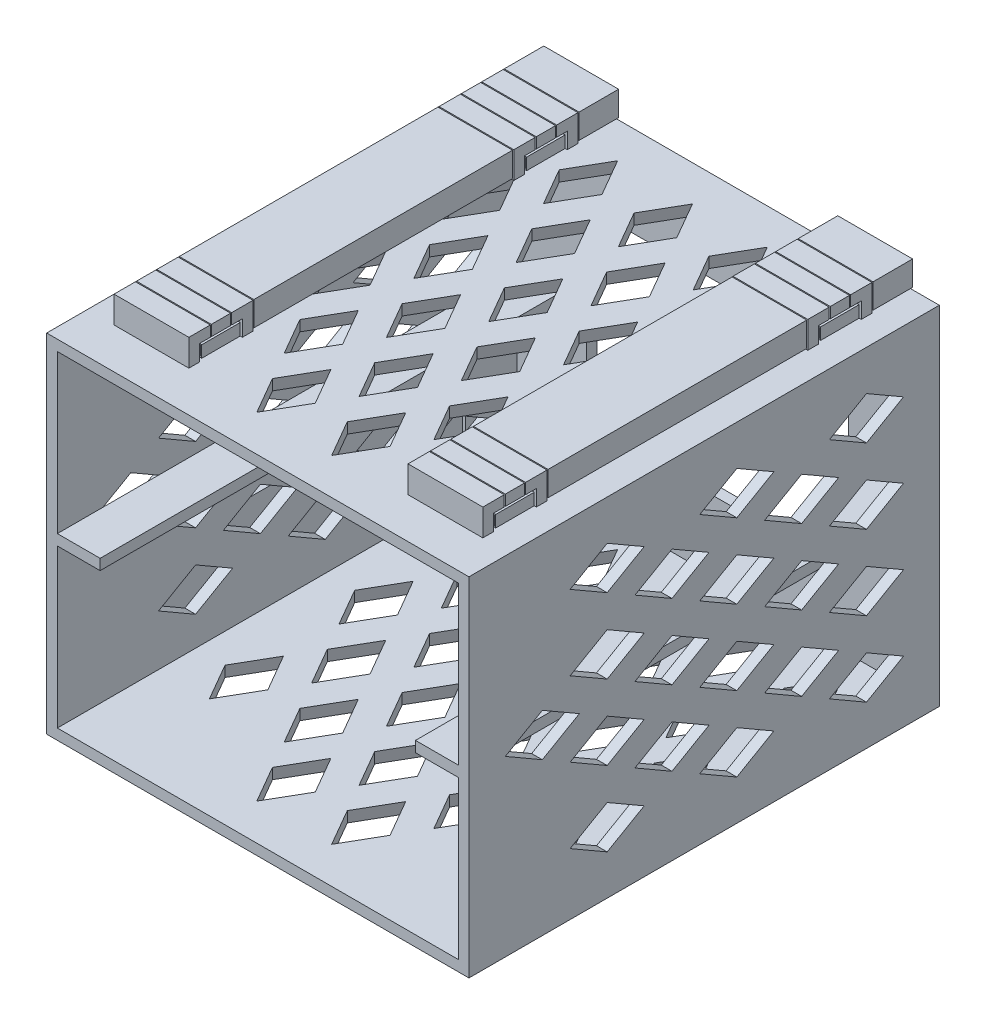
from build123d import *

# Parameters (mm, degrees)
CROQUIS1_W          = 79
CROQUIS1_H          = 65
CROQUIS1_W_2        = 49
CROQUIS1_H_2        = 35
FONDO_DEPTH         = 2
CROQUIS3_W          = 79
CROQUIS3_H          = 65
CROQUIS3_W_2        = 75
CROQUIS3_H_2        = 61
ESTRUCTURA_DEPTH    = 86
ROMBOSHOR_REACH     = 124.643
ROMBOSVERT_DEPTH    = 65
CROQUIS8_W          = 8
CROQUIS8_H          = 2
GUIAS_DEPTH         = 86
CROQUIS12_W         = 14
CROQUIS12_H         = 2
ANCSUP01_DEPTH      = 3
CROQUIS13_W         = 14
CROQUIS13_H         = 4
ANCSUP02_DEPTH      = 2
CROQUIS52_W         = 2
CROQUIS52_H         = 14
ANCIZQ01_DEPTH      = 3
CROQUIS53_W         = 4
CROQUIS53_H         = 14
ANCIZQ02_DEPTH      = 2
CROQUIS61_W         = 14
CROQUIS61_H         = 4.6
CROQUIS61_W_2       = 13.6
CROQUIS61_H_2       = 4.2
ESPANCSUP01_DEPTH   = 7.404
ESPANCSUP01_2_DEPTH = 7.404
CROQUIS57_W         = 13.954269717
CROQUIS57_H         = 4.6
CROQUIS57_W_2       = 13.554269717
CROQUIS57_H_2       = 4.2
ESPANCSUP02_DEPTH   = 48.392
ESPANCSUP02_2_DEPTH = 48.392
CROQUIS58_W         = 12.554269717
CROQUIS58_H         = 3.2
CROQUIS58_W_2       = 12.154269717
CROQUIS58_H_2       = 2.8
ESPANCSUP03_DEPTH   = 48.392
ESPANCSUP03_2_DEPTH = 48.392
CROQUIS59_W         = 11.154269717
CROQUIS59_H         = 1.8
CROQUIS59_W_2       = 10.754269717
CROQUIS59_H_2       = 1.4
ESPANCSUP04_DEPTH   = 48.392
ESPANCSUP04_2_DEPTH = 48.392
CROQUIS64_W         = 14
CROQUIS64_H         = 7.2
ESPANCSUP05_DEPTH   = 2.2
ESPANCSUP05_2_DEPTH = 2.2
ESPANCSUP05_3_DEPTH = 2.2
ESPANCSUP05_4_DEPTH = 2.2
CROQUIS66_W         = 13.6
CROQUIS66_H         = 1.8
ESPANCSUP06_DEPTH   = 7.2
CROQUIS68_W         = 13.6
CROQUIS68_H         = 1.8
ESPANCSUP07_DEPTH   = 7.2
CROQUIS70_W         = 14
CROQUIS70_H         = 3.6
ESPANCSUP08_DEPTH   = 2
ESPANCSUP08_2_DEPTH = 2
ESPANCSUP08_3_DEPTH = 2
ESPANCSUP08_4_DEPTH = 2
CROQUIS71_W         = 13.6
CROQUIS71_H         = 1.6
ESPANCSUP09_DEPTH   = 3.6
CROQUIS72_W         = 13.6
CROQUIS72_H         = 1.6
ESPANCSUP10_DEPTH   = 3.6
CROQUIS73_W         = 4.6
CROQUIS73_H         = 14
CROQUIS73_W_2       = 4.2
CROQUIS73_H_2       = 13.6
ESPANCIZQ01_DEPTH   = 7.404
ESPANCIZQ01_2_DEPTH = 7.404
CROQUIS74_W         = 4.6
CROQUIS74_H         = 14
CROQUIS74_W_2       = 4.2
CROQUIS74_H_2       = 13.6
ESPANCIZQ02_DEPTH   = 48.392
ESPANCIZQ02_2_DEPTH = 48.392
CROQUIS75_W         = 3.2
CROQUIS75_H         = 12.6
CROQUIS75_W_2       = 2.8
CROQUIS75_H_2       = 12.2
ESPANCIZQ03_DEPTH   = 48.392
ESPANCIZQ03_2_DEPTH = 48.392
CROQUIS76_W         = 1.8
CROQUIS76_H         = 11.2
CROQUIS76_W_2       = 1.4
CROQUIS76_H_2       = 10.8
ESPANCIZQ04_DEPTH   = 48.392
ESPANCIZQ04_2_DEPTH = 48.392
CROQUIS77_W         = 7.6
CROQUIS77_H         = 14
ESPANCIZQ05_DEPTH   = 2.2
ESPANCIZQ05_2_DEPTH = 2.2
ESPANCIZQ05_3_DEPTH = 2.2
ESPANCIZQ05_4_DEPTH = 2.2
CROQUIS78_W         = 1.8
CROQUIS78_H         = 13.6
ESPANCIZQ06_DEPTH   = 7.6
CROQUIS79_W         = 1.8
CROQUIS79_H         = 13.6
ESPANCIZQ07_DEPTH   = 7.6
CROQUIS80_W         = 3.6
CROQUIS80_H         = 14
ESPANCIZQ08_DEPTH   = 2
ESPANCIZQ08_2_DEPTH = 2
ESPANCIZQ08_3_DEPTH = 2
ESPANCIZQ08_4_DEPTH = 2
CROQUIS81_W         = 1.6
CROQUIS81_H         = 13.6
ESPANCIZQ09_DEPTH   = 3.6
CROQUIS82_W         = 1.6
CROQUIS82_H         = 13.6
ESPANCIZQ10_DEPTH   = 3.6


with BuildPart() as part:
    # Croquis1 → Fondo (new body)
    with BuildSketch(Plane(origin=(0, 0, 0), x_dir=(-1, 0, 0), z_dir=(0, 0, -1))):
        Rectangle(CROQUIS1_W, CROQUIS1_H)
        Rectangle(CROQUIS1_W_2, CROQUIS1_H_2, mode=Mode.SUBTRACT)
    extrude(amount=-FONDO_DEPTH)

    # Croquis3 → Estructura (add)
    with BuildSketch(Plane.XY.offset(2)):
        Rectangle(CROQUIS3_W, CROQUIS3_H)
        Rectangle(CROQUIS3_W_2, CROQUIS3_H_2, mode=Mode.SUBTRACT)
    extrude(amount=ESTRUCTURA_DEPTH)

    # RombosHor: up to this face of the body (flat: up to its plane)
    romboshor_end = Plane(part.part.faces().sort_by_distance((39.5, 0, 44))[0])
    # Croquis5 → RombosHor (cut, up to the picked face)
    with BuildSketch(Plane.ZY.offset(39.5), mode=Mode.PRIVATE) as romboshor_sk1:
        Polygon((13.628, 25), (20.556, 21), (13.628, 17), (6.7, 21), align=None)
    romboshor_tool1 = split(extrude(romboshor_sk1.sketch, amount=-ROMBOSHOR_REACH, mode=Mode.PRIVATE), bisect_by=romboshor_end, keep=Keep.BOTH, mode=Mode.PRIVATE)
    # Croquis5 → RombosHor (cut, up to the picked face)
    with BuildSketch(Plane.ZY.offset(39.5), mode=Mode.PRIVATE) as romboshor_sk2:
        Polygon((13.628, 11), (20.556, 7), (13.628, 3), (6.7, 7), align=None)
    romboshor_tool2 = split(extrude(romboshor_sk2.sketch, amount=-ROMBOSHOR_REACH, mode=Mode.PRIVATE), bisect_by=romboshor_end, keep=Keep.BOTH, mode=Mode.PRIVATE)
    # Croquis5 → RombosHor (cut, up to the picked face)
    with BuildSketch(Plane.ZY.offset(39.5), mode=Mode.PRIVATE) as romboshor_sk3:
        Polygon((13.628, -3), (20.556, -7), (13.628, -11), (6.7, -7), align=None)
    romboshor_tool3 = split(extrude(romboshor_sk3.sketch, amount=-ROMBOSHOR_REACH, mode=Mode.PRIVATE), bisect_by=romboshor_end, keep=Keep.BOTH, mode=Mode.PRIVATE)
    # Croquis5 → RombosHor (cut, up to the picked face)
    with BuildSketch(Plane.ZY.offset(39.5), mode=Mode.PRIVATE) as romboshor_sk4:
        Polygon((13.628, -17), (20.556, -21), (13.628, -25), (6.7, -21), align=None)
    romboshor_tool4 = split(extrude(romboshor_sk4.sketch, amount=-ROMBOSHOR_REACH, mode=Mode.PRIVATE), bisect_by=romboshor_end, keep=Keep.BOTH, mode=Mode.PRIVATE)
    # Croquis5 → RombosHor (cut, up to the picked face)
    with BuildSketch(Plane.ZY.offset(39.5), mode=Mode.PRIVATE) as romboshor_sk5:
        Polygon((37.884, 25), (44.812, 21), (37.884, 17), (30.956, 21), align=None)
    romboshor_tool5 = split(extrude(romboshor_sk5.sketch, amount=-ROMBOSHOR_REACH, mode=Mode.PRIVATE), bisect_by=romboshor_end, keep=Keep.BOTH, mode=Mode.PRIVATE)
    # Croquis5 → RombosHor (cut, up to the picked face)
    with BuildSketch(Plane.ZY.offset(39.5), mode=Mode.PRIVATE) as romboshor_sk6:
        Polygon((44.812, 7), (37.884, 3), (30.956, 7), (37.884, 11), align=None)
    romboshor_tool6 = split(extrude(romboshor_sk6.sketch, amount=-ROMBOSHOR_REACH, mode=Mode.PRIVATE), bisect_by=romboshor_end, keep=Keep.BOTH, mode=Mode.PRIVATE)
    # Croquis5 → RombosHor (cut, up to the picked face)
    with BuildSketch(Plane.ZY.offset(39.5), mode=Mode.PRIVATE) as romboshor_sk7:
        Polygon((44.812, -7), (37.884, -11), (30.956, -7), (37.884, -3), align=None)
    romboshor_tool7 = split(extrude(romboshor_sk7.sketch, amount=-ROMBOSHOR_REACH, mode=Mode.PRIVATE), bisect_by=romboshor_end, keep=Keep.BOTH, mode=Mode.PRIVATE)
    # Croquis5 → RombosHor (cut, up to the picked face)
    with BuildSketch(Plane.ZY.offset(39.5), mode=Mode.PRIVATE) as romboshor_sk8:
        Polygon((37.884, -17), (44.812, -21), (37.884, -25), (30.956, -21), align=None)
    romboshor_tool8 = split(extrude(romboshor_sk8.sketch, amount=-ROMBOSHOR_REACH, mode=Mode.PRIVATE), bisect_by=romboshor_end, keep=Keep.BOTH, mode=Mode.PRIVATE)
    # Croquis5 → RombosHor (cut, up to the picked face)
    with BuildSketch(Plane.ZY.offset(39.5), mode=Mode.PRIVATE) as romboshor_sk9:
        Polygon((62.14, 25), (69.068, 21), (62.14, 17), (55.212, 21), align=None)
    romboshor_tool9 = split(extrude(romboshor_sk9.sketch, amount=-ROMBOSHOR_REACH, mode=Mode.PRIVATE), bisect_by=romboshor_end, keep=Keep.BOTH, mode=Mode.PRIVATE)
    # Croquis5 → RombosHor (cut, up to the picked face)
    with BuildSketch(Plane.ZY.offset(39.5), mode=Mode.PRIVATE) as romboshor_sk10:
        Polygon((69.068, 7), (62.14, 3), (55.212, 7), (62.14, 11), align=None)
    romboshor_tool10 = split(extrude(romboshor_sk10.sketch, amount=-ROMBOSHOR_REACH, mode=Mode.PRIVATE), bisect_by=romboshor_end, keep=Keep.BOTH, mode=Mode.PRIVATE)
    # Croquis5 → RombosHor (cut, up to the picked face)
    with BuildSketch(Plane.ZY.offset(39.5), mode=Mode.PRIVATE) as romboshor_sk11:
        Polygon((69.068, -7), (62.14, -11), (55.212, -7), (62.14, -3), align=None)
    romboshor_tool11 = split(extrude(romboshor_sk11.sketch, amount=-ROMBOSHOR_REACH, mode=Mode.PRIVATE), bisect_by=romboshor_end, keep=Keep.BOTH, mode=Mode.PRIVATE)
    # Croquis5 → RombosHor (cut, up to the picked face)
    with BuildSketch(Plane.ZY.offset(39.5), mode=Mode.PRIVATE) as romboshor_sk12:
        Polygon((62.14, -17), (69.068, -21), (62.14, -25), (55.212, -21), align=None)
    romboshor_tool12 = split(extrude(romboshor_sk12.sketch, amount=-ROMBOSHOR_REACH, mode=Mode.PRIVATE), bisect_by=romboshor_end, keep=Keep.BOTH, mode=Mode.PRIVATE)
    # Croquis5 → RombosHor (cut, up to the picked face)
    with BuildSketch(Plane.ZY.offset(39.5), mode=Mode.PRIVATE) as romboshor_sk13:
        Polygon((50.012, 18), (56.94, 14), (50.012, 10), (43.084, 14), align=None)
    romboshor_tool13 = split(extrude(romboshor_sk13.sketch, amount=-ROMBOSHOR_REACH, mode=Mode.PRIVATE), bisect_by=romboshor_end, keep=Keep.BOTH, mode=Mode.PRIVATE)
    # Croquis5 → RombosHor (cut, up to the picked face)
    with BuildSketch(Plane.ZY.offset(39.5), mode=Mode.PRIVATE) as romboshor_sk14:
        Polygon((50.012, 4), (56.94, 0), (50.012, -4), (43.084, 0), align=None)
    romboshor_tool14 = split(extrude(romboshor_sk14.sketch, amount=-ROMBOSHOR_REACH, mode=Mode.PRIVATE), bisect_by=romboshor_end, keep=Keep.BOTH, mode=Mode.PRIVATE)
    # Croquis5 → RombosHor (cut, up to the picked face)
    with BuildSketch(Plane.ZY.offset(39.5), mode=Mode.PRIVATE) as romboshor_sk15:
        Polygon((56.94, -14), (50.012, -18), (43.084, -14), (50.012, -10), align=None)
    romboshor_tool15 = split(extrude(romboshor_sk15.sketch, amount=-ROMBOSHOR_REACH, mode=Mode.PRIVATE), bisect_by=romboshor_end, keep=Keep.BOTH, mode=Mode.PRIVATE)
    # Croquis5 → RombosHor (cut, up to the picked face)
    with BuildSketch(Plane.ZY.offset(39.5), mode=Mode.PRIVATE) as romboshor_sk16:
        Polygon((18.828, 14), (25.756, 18), (32.684, 14), (25.756, 10), align=None)
    romboshor_tool16 = split(extrude(romboshor_sk16.sketch, amount=-ROMBOSHOR_REACH, mode=Mode.PRIVATE), bisect_by=romboshor_end, keep=Keep.BOTH, mode=Mode.PRIVATE)
    # Croquis5 → RombosHor (cut, up to the picked face)
    with BuildSketch(Plane.ZY.offset(39.5), mode=Mode.PRIVATE) as romboshor_sk17:
        Polygon((25.756, 4), (32.684, 0), (25.756, -4), (18.828, 0), align=None)
    romboshor_tool17 = split(extrude(romboshor_sk17.sketch, amount=-ROMBOSHOR_REACH, mode=Mode.PRIVATE), bisect_by=romboshor_end, keep=Keep.BOTH, mode=Mode.PRIVATE)
    # Croquis5 → RombosHor (cut, up to the picked face)
    with BuildSketch(Plane.ZY.offset(39.5), mode=Mode.PRIVATE) as romboshor_sk18:
        Polygon((25.756, -18), (18.828, -14), (25.756, -10), (32.684, -14), align=None)
    romboshor_tool18 = split(extrude(romboshor_sk18.sketch, amount=-ROMBOSHOR_REACH, mode=Mode.PRIVATE), bisect_by=romboshor_end, keep=Keep.BOTH, mode=Mode.PRIVATE)
    # Croquis5 → RombosHor (cut, up to the picked face)
    with BuildSketch(Plane.ZY.offset(39.5), mode=Mode.PRIVATE) as romboshor_sk19:
        Polygon((81.196, 0), (74.268, -4), (67.34, 0), (74.268, 4), align=None)
    romboshor_tool19 = split(extrude(romboshor_sk19.sketch, amount=-ROMBOSHOR_REACH, mode=Mode.PRIVATE), bisect_by=romboshor_end, keep=Keep.BOTH, mode=Mode.PRIVATE)
    add(romboshor_tool1.solids().sort_by(Axis((-39.5, 21, 13.628), (1, 0, 0)))[0], mode=Mode.SUBTRACT)
    add(romboshor_tool2.solids().sort_by(Axis((-39.5, 7, 13.628), (1, 0, 0)))[0], mode=Mode.SUBTRACT)
    add(romboshor_tool3.solids().sort_by(Axis((-39.5, -7, 13.628), (1, 0, 0)))[0], mode=Mode.SUBTRACT)
    add(romboshor_tool4.solids().sort_by(Axis((-39.5, -21, 13.628), (1, 0, 0)))[0], mode=Mode.SUBTRACT)
    add(romboshor_tool5.solids().sort_by(Axis((-39.5, 21, 37.884), (1, 0, 0)))[0], mode=Mode.SUBTRACT)
    add(romboshor_tool6.solids().sort_by(Axis((-39.5, 7, 37.884), (1, 0, 0)))[0], mode=Mode.SUBTRACT)
    add(romboshor_tool7.solids().sort_by(Axis((-39.5, -7, 37.884), (1, 0, 0)))[0], mode=Mode.SUBTRACT)
    add(romboshor_tool8.solids().sort_by(Axis((-39.5, -21, 37.884), (1, 0, 0)))[0], mode=Mode.SUBTRACT)
    add(romboshor_tool9.solids().sort_by(Axis((-39.5, 21, 62.14), (1, 0, 0)))[0], mode=Mode.SUBTRACT)
    add(romboshor_tool10.solids().sort_by(Axis((-39.5, 7, 62.14), (1, 0, 0)))[0], mode=Mode.SUBTRACT)
    add(romboshor_tool11.solids().sort_by(Axis((-39.5, -7, 62.14), (1, 0, 0)))[0], mode=Mode.SUBTRACT)
    add(romboshor_tool12.solids().sort_by(Axis((-39.5, -21, 62.14), (1, 0, 0)))[0], mode=Mode.SUBTRACT)
    add(romboshor_tool13.solids().sort_by(Axis((-39.5, 14, 50.012), (1, 0, 0)))[0], mode=Mode.SUBTRACT)
    add(romboshor_tool14.solids().sort_by(Axis((-39.5, 0, 50.012), (1, 0, 0)))[0], mode=Mode.SUBTRACT)
    add(romboshor_tool15.solids().sort_by(Axis((-39.5, -14, 50.012), (1, 0, 0)))[0], mode=Mode.SUBTRACT)
    add(romboshor_tool16.solids().sort_by(Axis((-39.5, 14, 25.756), (1, 0, 0)))[0], mode=Mode.SUBTRACT)
    add(romboshor_tool17.solids().sort_by(Axis((-39.5, 0, 25.756), (1, 0, 0)))[0], mode=Mode.SUBTRACT)
    add(romboshor_tool18.solids().sort_by(Axis((-39.5, -14, 25.756), (1, 0, 0)))[0], mode=Mode.SUBTRACT)
    add(romboshor_tool19.solids().sort_by(Axis((-39.5, 0, 74.268), (1, 0, 0)))[0], mode=Mode.SUBTRACT)

    # Croquis9 → RombosVert (cut)
    with BuildSketch(Plane(origin=(0, 32.5, 0), x_dir=(1, 0, 0), z_dir=(0, 1, 0))):
        Polygon((28, -6.68718177), (24, -13.615385), (28, -20.543588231), (32, -13.615385), align=None)
        Polygon((14, -6.68718177), (10, -13.615385), (14, -20.543588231), (18, -13.615385), align=None)
        Polygon((0, -6.68718177), (-4, -13.615385), (0, -20.543588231), (4, -13.615385), align=None)
        Polygon((-14, -6.68718177), (-18, -13.615385), (-14, -20.543588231), (-10, -13.615385), align=None)
        Polygon((-28, -6.68718177), (-32, -13.615385), (-28, -20.543588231), (-24, -13.615385), align=None)
        Polygon((14, -30.94359177), (10, -37.871795), (14, -44.799998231), (18, -37.871795), align=None)
        Polygon((0, -30.94359177), (-4, -37.871795), (0, -44.799998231), (4, -37.871795), align=None)
        Polygon((-14, -30.94359177), (-18, -37.871795), (-14, -44.799998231), (-10, -37.871795), align=None)
        Polygon((-28, -30.94359177), (-32, -37.871795), (-28, -44.799998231), (-24, -37.871795), align=None)
        Polygon((14, -55.20000177), (10, -62.128205), (14, -69.056408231), (18, -62.128205), align=None)
        Polygon((0, -55.20000177), (-4, -62.128205), (0, -69.056408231), (4, -62.128205), align=None)
        Polygon((-14, -55.20000177), (-18, -62.128205), (-14, -69.056408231), (-10, -62.128205), align=None)
        Polygon((-28, -55.20000177), (-32, -62.128205), (-28, -69.056408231), (-24, -62.128205), align=None)
        Polygon((28, -30.94359177), (24, -37.871795), (28, -44.799998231), (32, -37.871795), align=None)
        Polygon((28, -55.20000177), (24, -62.128205), (28, -69.056408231), (32, -62.128205), align=None)
        Polygon((17, -50.001795), (21, -56.929998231), (25, -50.001795), (21, -43.07359177), align=None)
        Polygon((7, -67.33000177), (11, -74.258205), (7, -81.186408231), (3, -74.258205), align=None)
        Polygon((-7, -67.33000177), (-11, -74.258205), (-7, -81.186408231), (-3, -74.258205), align=None)
        Polygon((7, -18.81718177), (3, -25.745385), (7, -32.673588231), (11, -25.745385), align=None)
        Polygon((17, -25.745385), (21, -32.673588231), (25, -25.745385), (21, -18.81718177), align=None)
        Polygon((-7, -43.07359177), (-11, -50.001795), (-7, -56.929998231), (-3, -50.001795), align=None)
        Polygon((-21, -43.07359177), (-25, -50.001795), (-21, -56.929998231), (-17, -50.001795), align=None)
        Polygon((-3, -25.745385), (-7, -32.673588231), (-11, -25.745385), (-7, -18.81718177), align=None)
        Polygon((-21, -18.81718177), (-17, -25.745385), (-21, -32.673588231), (-25, -25.745385), align=None)
        Polygon((7, -43.07359177), (3, -50.001795), (7, -56.929998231), (11, -50.001795), align=None)
    extrude(amount=-ROMBOSVERT_DEPTH, mode=Mode.SUBTRACT)

    # Croquis8 → Guias (add)
    with BuildSketch(Plane.XY.offset(2)):
        with Locations((-33.5, 0)):
            Rectangle(CROQUIS8_W, CROQUIS8_H)
        with Locations((33.5, 0)):
            Rectangle(CROQUIS8_W, CROQUIS8_H)
    extrude(amount=GUIAS_DEPTH)

    # Croquis12 → AncSup01 (add)
    with BuildSketch(Plane(origin=(0, 32.5, 0), x_dir=(1, 0, 0), z_dir=(0, 1, 0))):
        with Locations((27.5, -8.604)):
            Rectangle(CROQUIS12_W, CROQUIS12_H)
        with Locations((27.5, -18.604)):
            Rectangle(CROQUIS12_W, CROQUIS12_H)
        with Locations((-27.5, -79.396)):
            Rectangle(CROQUIS12_W, CROQUIS12_H)
        with Locations((-27.5, -69.396)):
            Rectangle(CROQUIS12_W, CROQUIS12_H)
        with Locations((27.5, -69.396)):
            Rectangle(CROQUIS12_W, CROQUIS12_H)
        with Locations((-27.5, -18.604)):
            Rectangle(CROQUIS12_W, CROQUIS12_H)
        with Locations((-27.5, -8.604)):
            Rectangle(CROQUIS12_W, CROQUIS12_H)
        with Locations((27.5, -79.396)):
            Rectangle(CROQUIS12_W, CROQUIS12_H)
    extrude(amount=ANCSUP01_DEPTH)

    # Croquis13 → AncSup02 (add)
    with BuildSketch(Plane(origin=(0, 35.5, 0), x_dir=(1, 0, 0), z_dir=(0, 1, 0))):
        with Locations((-27.5, -9.604)):
            Rectangle(CROQUIS13_W, CROQUIS13_H)
        with Locations((-27.5, -17.604)):
            Rectangle(CROQUIS13_W, CROQUIS13_H)
        with Locations((27.5, -17.604)):
            Rectangle(CROQUIS13_W, CROQUIS13_H)
        with Locations((27.5, -9.604)):
            Rectangle(CROQUIS13_W, CROQUIS13_H)
        with Locations((27.5, -78.396)):
            Rectangle(CROQUIS13_W, CROQUIS13_H)
        with Locations((27.5, -70.396)):
            Rectangle(CROQUIS13_W, CROQUIS13_H)
        with Locations((-27.5, -70.396)):
            Rectangle(CROQUIS13_W, CROQUIS13_H)
        with Locations((-27.5, -78.396)):
            Rectangle(CROQUIS13_W, CROQUIS13_H)
    extrude(amount=ANCSUP02_DEPTH)

    # Croquis52 → AncIzq01 (add)
    with BuildSketch(Plane.ZY.offset(39.5)):
        with Locations((8.604, -20.5)):
            Rectangle(CROQUIS52_W, CROQUIS52_H)
        with Locations((18.604, -20.5)):
            Rectangle(CROQUIS52_W, CROQUIS52_H)
        with Locations((79.396, 20.5)):
            Rectangle(CROQUIS52_W, CROQUIS52_H)
        with Locations((69.396, 20.5)):
            Rectangle(CROQUIS52_W, CROQUIS52_H)
        with Locations((69.396, -20.5)):
            Rectangle(CROQUIS52_W, CROQUIS52_H)
        with Locations((79.396, -20.5)):
            Rectangle(CROQUIS52_W, CROQUIS52_H)
        with Locations((18.604, 20.5)):
            Rectangle(CROQUIS52_W, CROQUIS52_H)
        with Locations((8.604, 20.5)):
            Rectangle(CROQUIS52_W, CROQUIS52_H)
    extrude(amount=ANCIZQ01_DEPTH)

    # Croquis53 → AncIzq02 (add)
    with BuildSketch(Plane.ZY.offset(42.5)):
        with Locations((9.604, 20.5)):
            Rectangle(CROQUIS53_W, CROQUIS53_H)
        with Locations((17.604, 20.5)):
            Rectangle(CROQUIS53_W, CROQUIS53_H)
        with Locations((17.604, -20.5)):
            Rectangle(CROQUIS53_W, CROQUIS53_H)
        with Locations((9.604, -20.5)):
            Rectangle(CROQUIS53_W, CROQUIS53_H)
        with Locations((78.396, -20.5)):
            Rectangle(CROQUIS53_W, CROQUIS53_H)
        with Locations((70.396, -20.5)):
            Rectangle(CROQUIS53_W, CROQUIS53_H)
        with Locations((70.396, 20.5)):
            Rectangle(CROQUIS53_W, CROQUIS53_H)
        with Locations((78.396, 20.5)):
            Rectangle(CROQUIS53_W, CROQUIS53_H)
    extrude(amount=ANCIZQ02_DEPTH)


with BuildPart() as body_2:
    # Croquis61 → EspAncSup01 (new body)
    with BuildSketch(Plane(origin=(0, 0, 0), x_dir=(-1, 0, 0), z_dir=(0, 0, -1))):
        with Locations((27.5, 35.2)):
            Rectangle(CROQUIS61_W, CROQUIS61_H)
        with Locations((27.5, 35.2)):
            Rectangle(CROQUIS61_W_2, CROQUIS61_H_2, mode=Mode.SUBTRACT)
    extrude(amount=-ESPANCSUP01_DEPTH)


with BuildPart() as body_3:
    # Croquis61 → EspAncSup01 2 (new body)
    with BuildSketch(Plane(origin=(0, 0, 0), x_dir=(-1, 0, 0), z_dir=(0, 0, -1))):
        with Locations((-27.5, 35.2)):
            Rectangle(CROQUIS61_W, CROQUIS61_H)
        with Locations((-27.5, 35.2)):
            Rectangle(CROQUIS61_W_2, CROQUIS61_H_2, mode=Mode.SUBTRACT)
    extrude(amount=-ESPANCSUP01_2_DEPTH)


with BuildPart() as body_4:
    # Croquis57 → EspAncSup02 (new body)
    with BuildSketch(Plane.XY.offset(19.804)):
        with Locations((27.522865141, 35.2)):
            Rectangle(CROQUIS57_W, CROQUIS57_H)
        with Locations((27.522865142, 35.2)):
            Rectangle(CROQUIS57_W_2, CROQUIS57_H_2, mode=Mode.SUBTRACT)
    extrude(amount=ESPANCSUP02_DEPTH)


with BuildPart() as body_5:
    # Croquis57 → EspAncSup02 2 (new body)
    with BuildSketch(Plane.XY.offset(19.804)):
        with Locations((-27.522865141, 35.2)):
            Rectangle(CROQUIS57_W, CROQUIS57_H)
        with Locations((-27.522865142, 35.2)):
            Rectangle(CROQUIS57_W_2, CROQUIS57_H_2, mode=Mode.SUBTRACT)
    extrude(amount=ESPANCSUP02_2_DEPTH)


with BuildPart() as body_6:
    # Croquis58 → EspAncSup03 (new body)
    with BuildSketch(Plane.XY.offset(19.804)):
        with Locations((27.522865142, 35.2)):
            Rectangle(CROQUIS58_W, CROQUIS58_H)
        with Locations((27.522865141, 35.2)):
            Rectangle(CROQUIS58_W_2, CROQUIS58_H_2, mode=Mode.SUBTRACT)
    extrude(amount=ESPANCSUP03_DEPTH)


with BuildPart() as body_7:
    # Croquis58 → EspAncSup03 2 (new body)
    with BuildSketch(Plane.XY.offset(19.804)):
        with Locations((-27.522865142, 35.2)):
            Rectangle(CROQUIS58_W, CROQUIS58_H)
        with Locations((-27.522865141, 35.2)):
            Rectangle(CROQUIS58_W_2, CROQUIS58_H_2, mode=Mode.SUBTRACT)
    extrude(amount=ESPANCSUP03_2_DEPTH)


with BuildPart() as body_8:
    # Croquis59 → EspAncSup04 (new body)
    with BuildSketch(Plane.XY.offset(19.804)):
        with Locations((27.522865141, 35.2)):
            Rectangle(CROQUIS59_W, CROQUIS59_H)
        with Locations((27.522865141, 35.2)):
            Rectangle(CROQUIS59_W_2, CROQUIS59_H_2, mode=Mode.SUBTRACT)
    extrude(amount=ESPANCSUP04_DEPTH)


with BuildPart() as body_9:
    # Croquis59 → EspAncSup04 2 (new body)
    with BuildSketch(Plane.XY.offset(19.804)):
        with Locations((-27.522865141, 35.2)):
            Rectangle(CROQUIS59_W, CROQUIS59_H)
        with Locations((-27.522865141, 35.2)):
            Rectangle(CROQUIS59_W_2, CROQUIS59_H_2, mode=Mode.SUBTRACT)
    extrude(amount=ESPANCSUP04_2_DEPTH)


with BuildPart() as body_10:
    # Croquis64 → EspAncSup05 (new body)
    with BuildSketch(Plane(origin=(0, 32.9, 0), x_dir=(1, 0, 0), z_dir=(0, 1, 0))):
        with Locations((-27.5, -13.604)):
            Rectangle(CROQUIS64_W, CROQUIS64_H)
    extrude(amount=ESPANCSUP05_DEPTH)


with BuildPart() as body_11:
    # Croquis64 → EspAncSup05 2 (new body)
    with BuildSketch(Plane(origin=(0, 32.9, 0), x_dir=(1, 0, 0), z_dir=(0, 1, 0))):
        with Locations((27.5, -13.604)):
            Rectangle(CROQUIS64_W, CROQUIS64_H)
    extrude(amount=ESPANCSUP05_2_DEPTH)


with BuildPart() as body_12:
    # Croquis64 → EspAncSup05 3 (new body)
    with BuildSketch(Plane(origin=(0, 32.9, 0), x_dir=(1, 0, 0), z_dir=(0, 1, 0))):
        with Locations((27.5, -74.396)):
            Rectangle(CROQUIS64_W, CROQUIS64_H)
    extrude(amount=ESPANCSUP05_3_DEPTH)


with BuildPart() as body_13:
    # Croquis64 → EspAncSup05 4 (new body)
    with BuildSketch(Plane(origin=(0, 32.9, 0), x_dir=(1, 0, 0), z_dir=(0, 1, 0))):
        with Locations((-27.5, -74.396)):
            Rectangle(CROQUIS64_W, CROQUIS64_H)
    extrude(amount=ESPANCSUP05_4_DEPTH)


with BuildPart() as espancsup06_tool:
    # Croquis66 → EspAncSup06 (new body)
    with BuildSketch(Plane.XY.offset(17.204)):
        with Locations((-27.5, 34)):
            Rectangle(CROQUIS66_W, CROQUIS66_H)
        with Locations((27.5, 34)):
            Rectangle(CROQUIS66_W, CROQUIS66_H)
    extrude(amount=-ESPANCSUP06_DEPTH)


with BuildPart() as body_10_1:
    add(body_10.part)

    # EspAncSup06: cut by espancsup06_tool
    add(espancsup06_tool.part, mode=Mode.SUBTRACT)


with BuildPart() as body_11_1:
    add(body_11.part)

    # EspAncSup06: cut by espancsup06_tool
    add(espancsup06_tool.part, mode=Mode.SUBTRACT)


with BuildPart() as espancsup07_tool:
    # Croquis68 → EspAncSup07 (new body)
    with BuildSketch(Plane.XY.offset(77.996)):
        with Locations((27.5, 34)):
            Rectangle(CROQUIS68_W, CROQUIS68_H)
        with Locations((-27.5, 34)):
            Rectangle(CROQUIS68_W, CROQUIS68_H)
    extrude(amount=-ESPANCSUP07_DEPTH)


with BuildPart() as body_12_1:
    add(body_12.part)

    # EspAncSup07: cut by espancsup07_tool
    add(espancsup07_tool.part, mode=Mode.SUBTRACT)


with BuildPart() as body_13_1:
    add(body_13.part)

    # EspAncSup07: cut by espancsup07_tool
    add(espancsup07_tool.part, mode=Mode.SUBTRACT)


with BuildPart() as body_14:
    # Croquis70 → EspAncSup08 (new body)
    with BuildSketch(Plane.XZ.offset(-35.5)):
        with Locations((-27.5, 74.396)):
            Rectangle(CROQUIS70_W, CROQUIS70_H)
    extrude(amount=-ESPANCSUP08_DEPTH)


with BuildPart() as body_15:
    # Croquis70 → EspAncSup08 2 (new body)
    with BuildSketch(Plane.XZ.offset(-35.5)):
        with Locations((27.5, 13.604)):
            Rectangle(CROQUIS70_W, CROQUIS70_H)
    extrude(amount=-ESPANCSUP08_2_DEPTH)


with BuildPart() as body_16:
    # Croquis70 → EspAncSup08 3 (new body)
    with BuildSketch(Plane.XZ.offset(-35.5)):
        with Locations((27.5, 74.396)):
            Rectangle(CROQUIS70_W, CROQUIS70_H)
    extrude(amount=-ESPANCSUP08_3_DEPTH)


with BuildPart() as body_17:
    # Croquis70 → EspAncSup08 4 (new body)
    with BuildSketch(Plane.XZ.offset(-35.5)):
        with Locations((-27.5, 13.604)):
            Rectangle(CROQUIS70_W, CROQUIS70_H)
    extrude(amount=-ESPANCSUP08_4_DEPTH)


with BuildPart() as espancsup09_tool:
    # Croquis71 → EspAncSup09 (new body)
    with BuildSketch(Plane(origin=(0, 0, 72.596), x_dir=(-1, 0, 0), z_dir=(0, 0, -1))):
        with Locations((-27.5, 36.5)):
            Rectangle(CROQUIS71_W, CROQUIS71_H)
        with Locations((27.5, 36.5)):
            Rectangle(CROQUIS71_W, CROQUIS71_H)
    extrude(amount=-ESPANCSUP09_DEPTH)


with BuildPart() as body_14_1:
    add(body_14.part)

    # EspAncSup09: cut by espancsup09_tool
    add(espancsup09_tool.part, mode=Mode.SUBTRACT)


with BuildPart() as body_16_1:
    add(body_16.part)

    # EspAncSup09: cut by espancsup09_tool
    add(espancsup09_tool.part, mode=Mode.SUBTRACT)


with BuildPart() as espancsup10_tool:
    # Croquis72 → EspAncSup10 (new body)
    with BuildSketch(Plane(origin=(0, 0, 11.804), x_dir=(-1, 0, 0), z_dir=(0, 0, -1))):
        with Locations((-27.5, 36.5)):
            Rectangle(CROQUIS72_W, CROQUIS72_H)
        with Locations((27.5, 36.5)):
            Rectangle(CROQUIS72_W, CROQUIS72_H)
    extrude(amount=-ESPANCSUP10_DEPTH)


with BuildPart() as body_15_1:
    add(body_15.part)

    # EspAncSup10: cut by espancsup10_tool
    add(espancsup10_tool.part, mode=Mode.SUBTRACT)


with BuildPart() as body_17_1:
    add(body_17.part)

    # EspAncSup10: cut by espancsup10_tool
    add(espancsup10_tool.part, mode=Mode.SUBTRACT)


with BuildPart() as body_18:
    # Croquis73 → EspAncIzq01 (new body)
    with BuildSketch(Plane(origin=(0, 0, 0), x_dir=(-1, 0, 0), z_dir=(0, 0, -1))):
        with Locations((42.2, 20.5)):
            Rectangle(CROQUIS73_W, CROQUIS73_H)
        with Locations((42.2, 20.5)):
            Rectangle(CROQUIS73_W_2, CROQUIS73_H_2, mode=Mode.SUBTRACT)
    extrude(amount=-ESPANCIZQ01_DEPTH)


with BuildPart() as body_19:
    # Croquis73 → EspAncIzq01 2 (new body)
    with BuildSketch(Plane(origin=(0, 0, 0), x_dir=(-1, 0, 0), z_dir=(0, 0, -1))):
        with Locations((42.2, -20.5)):
            Rectangle(CROQUIS73_W, CROQUIS73_H)
        with Locations((42.2, -20.5)):
            Rectangle(CROQUIS73_W_2, CROQUIS73_H_2, mode=Mode.SUBTRACT)
    extrude(amount=-ESPANCIZQ01_2_DEPTH)


with BuildPart() as body_20:
    # Croquis74 → EspAncIzq02 (new body)
    with BuildSketch(Plane.XY.offset(19.804)):
        with Locations((-42.2, 20.5)):
            Rectangle(CROQUIS74_W, CROQUIS74_H)
        with Locations((-42.2, 20.5)):
            Rectangle(CROQUIS74_W_2, CROQUIS74_H_2, mode=Mode.SUBTRACT)
    extrude(amount=ESPANCIZQ02_DEPTH)


with BuildPart() as body_21:
    # Croquis74 → EspAncIzq02 2 (new body)
    with BuildSketch(Plane.XY.offset(19.804)):
        with Locations((-42.2, -20.5)):
            Rectangle(CROQUIS74_W, CROQUIS74_H)
        with Locations((-42.2, -20.5)):
            Rectangle(CROQUIS74_W_2, CROQUIS74_H_2, mode=Mode.SUBTRACT)
    extrude(amount=ESPANCIZQ02_2_DEPTH)


with BuildPart() as body_22:
    # Croquis75 → EspAncIzq03 (new body)
    with BuildSketch(Plane.XY.offset(19.804)):
        with Locations((-42.2, 20.5)):
            Rectangle(CROQUIS75_W, CROQUIS75_H)
        with Locations((-42.2, 20.5)):
            Rectangle(CROQUIS75_W_2, CROQUIS75_H_2, mode=Mode.SUBTRACT)
    extrude(amount=ESPANCIZQ03_DEPTH)


with BuildPart() as body_23:
    # Croquis75 → EspAncIzq03 2 (new body)
    with BuildSketch(Plane.XY.offset(19.804)):
        with Locations((-42.2, -20.5)):
            Rectangle(CROQUIS75_W, CROQUIS75_H)
        with Locations((-42.2, -20.5)):
            Rectangle(CROQUIS75_W_2, CROQUIS75_H_2, mode=Mode.SUBTRACT)
    extrude(amount=ESPANCIZQ03_2_DEPTH)


with BuildPart() as body_24:
    # Croquis76 → EspAncIzq04 (new body)
    with BuildSketch(Plane.XY.offset(19.804)):
        with Locations((-42.2, 20.5)):
            Rectangle(CROQUIS76_W, CROQUIS76_H)
        with Locations((-42.2, 20.5)):
            Rectangle(CROQUIS76_W_2, CROQUIS76_H_2, mode=Mode.SUBTRACT)
    extrude(amount=ESPANCIZQ04_DEPTH)


with BuildPart() as body_25:
    # Croquis76 → EspAncIzq04 2 (new body)
    with BuildSketch(Plane.XY.offset(19.804)):
        with Locations((-42.2, -20.5)):
            Rectangle(CROQUIS76_W, CROQUIS76_H)
        with Locations((-42.2, -20.5)):
            Rectangle(CROQUIS76_W_2, CROQUIS76_H_2, mode=Mode.SUBTRACT)
    extrude(amount=ESPANCIZQ04_2_DEPTH)


with BuildPart() as body_26:
    # Croquis77 → EspAncIzq05 (new body)
    with BuildSketch(Plane.ZY.offset(39.9)):
        with Locations((13.604, 20.5)):
            Rectangle(CROQUIS77_W, CROQUIS77_H)
    extrude(amount=ESPANCIZQ05_DEPTH)


with BuildPart() as body_27:
    # Croquis77 → EspAncIzq05 2 (new body)
    with BuildSketch(Plane.ZY.offset(39.9)):
        with Locations((74.396, 20.5)):
            Rectangle(CROQUIS77_W, CROQUIS77_H)
    extrude(amount=ESPANCIZQ05_2_DEPTH)


with BuildPart() as body_28:
    # Croquis77 → EspAncIzq05 3 (new body)
    with BuildSketch(Plane.ZY.offset(39.9)):
        with Locations((74.396, -20.5)):
            Rectangle(CROQUIS77_W, CROQUIS77_H)
    extrude(amount=ESPANCIZQ05_3_DEPTH)


with BuildPart() as body_29:
    # Croquis77 → EspAncIzq05 4 (new body)
    with BuildSketch(Plane.ZY.offset(39.9)):
        with Locations((13.604, -20.5)):
            Rectangle(CROQUIS77_W, CROQUIS77_H)
    extrude(amount=ESPANCIZQ05_4_DEPTH)


with BuildPart() as espancizq06_tool:
    # Croquis78 → EspAncIzq06 (new body)
    with BuildSketch(Plane(origin=(0, 0, 9.804), x_dir=(-1, 0, 0), z_dir=(0, 0, -1))):
        with Locations((41, 20.5)):
            Rectangle(CROQUIS78_W, CROQUIS78_H)
        with Locations((41, -20.5)):
            Rectangle(CROQUIS78_W, CROQUIS78_H)
    extrude(amount=-ESPANCIZQ06_DEPTH)


with BuildPart() as body_26_1:
    add(body_26.part)

    # EspAncIzq06: cut by espancizq06_tool
    add(espancizq06_tool.part, mode=Mode.SUBTRACT)


with BuildPart() as body_29_1:
    add(body_29.part)

    # EspAncIzq06: cut by espancizq06_tool
    add(espancizq06_tool.part, mode=Mode.SUBTRACT)


with BuildPart() as espancizq07_tool:
    # Croquis79 → EspAncIzq07 (new body)
    with BuildSketch(Plane(origin=(0, 0, 70.596), x_dir=(-1, 0, 0), z_dir=(0, 0, -1))):
        with Locations((41, 20.5)):
            Rectangle(CROQUIS79_W, CROQUIS79_H)
        with Locations((41, -20.5)):
            Rectangle(CROQUIS79_W, CROQUIS79_H)
    extrude(amount=-ESPANCIZQ07_DEPTH)


with BuildPart() as body_27_1:
    add(body_27.part)

    # EspAncIzq07: cut by espancizq07_tool
    add(espancizq07_tool.part, mode=Mode.SUBTRACT)


with BuildPart() as body_28_1:
    add(body_28.part)

    # EspAncIzq07: cut by espancizq07_tool
    add(espancizq07_tool.part, mode=Mode.SUBTRACT)


with BuildPart() as body_30:
    # Croquis80 → EspAncIzq08 (new body)
    with BuildSketch(Plane(origin=(-42.5, 0, 0), x_dir=(0, 0, -1), z_dir=(1, 0, 0))):
        with Locations((-13.604, -20.5)):
            Rectangle(CROQUIS80_W, CROQUIS80_H)
    extrude(amount=-ESPANCIZQ08_DEPTH)


with BuildPart() as body_31:
    # Croquis80 → EspAncIzq08 2 (new body)
    with BuildSketch(Plane(origin=(-42.5, 0, 0), x_dir=(0, 0, -1), z_dir=(1, 0, 0))):
        with Locations((-74.396, -20.5)):
            Rectangle(CROQUIS80_W, CROQUIS80_H)
    extrude(amount=-ESPANCIZQ08_2_DEPTH)


with BuildPart() as body_32:
    # Croquis80 → EspAncIzq08 3 (new body)
    with BuildSketch(Plane(origin=(-42.5, 0, 0), x_dir=(0, 0, -1), z_dir=(1, 0, 0))):
        with Locations((-74.396, 20.5)):
            Rectangle(CROQUIS80_W, CROQUIS80_H)
    extrude(amount=-ESPANCIZQ08_3_DEPTH)


with BuildPart() as body_33:
    # Croquis80 → EspAncIzq08 4 (new body)
    with BuildSketch(Plane(origin=(-42.5, 0, 0), x_dir=(0, 0, -1), z_dir=(1, 0, 0))):
        with Locations((-13.604, 20.5)):
            Rectangle(CROQUIS80_W, CROQUIS80_H)
    extrude(amount=-ESPANCIZQ08_4_DEPTH)


with BuildPart() as espancizq09_tool:
    # Croquis81 → EspAncIzq09 (new body)
    with BuildSketch(Plane(origin=(0, 0, 11.804), x_dir=(-1, 0, 0), z_dir=(0, 0, -1))):
        with Locations((43.5, -20.5)):
            Rectangle(CROQUIS81_W, CROQUIS81_H)
        with Locations((43.5, 20.5)):
            Rectangle(CROQUIS81_W, CROQUIS81_H)
    extrude(amount=-ESPANCIZQ09_DEPTH)


with BuildPart() as body_30_1:
    add(body_30.part)

    # EspAncIzq09: cut by espancizq09_tool
    add(espancizq09_tool.part, mode=Mode.SUBTRACT)


with BuildPart() as body_33_1:
    add(body_33.part)

    # EspAncIzq09: cut by espancizq09_tool
    add(espancizq09_tool.part, mode=Mode.SUBTRACT)


with BuildPart() as espancizq10_tool:
    # Croquis82 → EspAncIzq10 (new body)
    with BuildSketch(Plane(origin=(0, 0, 72.596), x_dir=(-1, 0, 0), z_dir=(0, 0, -1))):
        with Locations((43.5, 20.5)):
            Rectangle(CROQUIS82_W, CROQUIS82_H)
        with Locations((43.5, -20.5)):
            Rectangle(CROQUIS82_W, CROQUIS82_H)
    extrude(amount=-ESPANCIZQ10_DEPTH)


with BuildPart() as body_31_1:
    add(body_31.part)

    # EspAncIzq10: cut by espancizq10_tool
    add(espancizq10_tool.part, mode=Mode.SUBTRACT)


with BuildPart() as body_32_1:
    add(body_32.part)

    # EspAncIzq10: cut by espancizq10_tool
    add(espancizq10_tool.part, mode=Mode.SUBTRACT)


solid = Compound([part.part, body_2.part, body_3.part, body_4.part, body_5.part, body_6.part, body_7.part, body_8.part, body_9.part, body_10_1.part, body_11_1.part, body_12_1.part, body_13_1.part, body_14_1.part, body_16_1.part, body_15_1.part, body_17_1.part, body_18.part, body_19.part, body_20.part, body_21.part, body_22.part, body_23.part, body_24.part, body_25.part, body_26_1.part, body_29_1.part, body_27_1.part, body_28_1.part, body_30_1.part, body_33_1.part, body_31_1.part, body_32_1.part])
